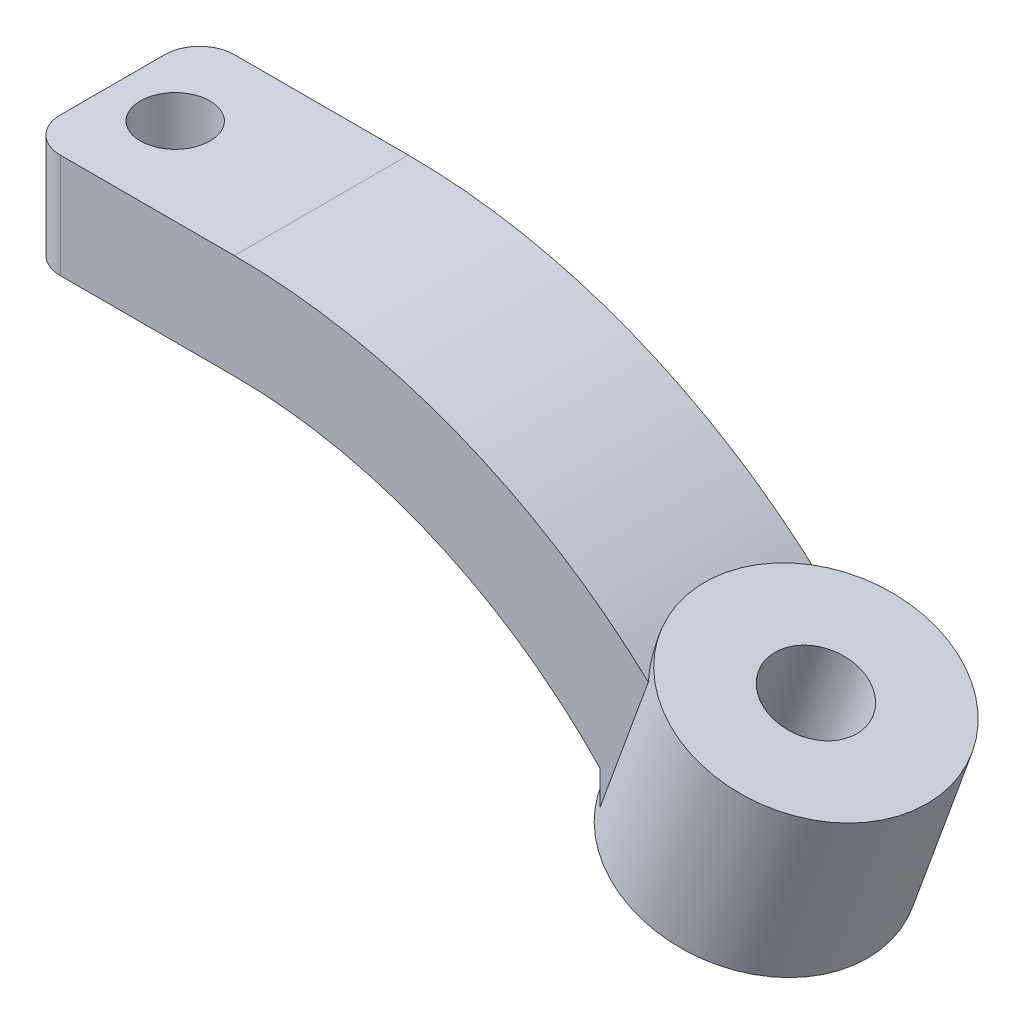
ISO-10303-21;
HEADER;
FILE_DESCRIPTION(('STEP AP214'),'2;1');
FILE_NAME('part.step','',(''),(''),'','','');
FILE_SCHEMA(('AUTOMOTIVE_DESIGN { 1 0 10303 214 1 1 1 1 }'));
ENDSEC;
DATA;
#1=APPLICATION_CONTEXT('core data for automotive mechanical design processes');
#2=APPLICATION_PROTOCOL_DEFINITION('international standard','automotive_design',2000,#1);
#3=PRODUCT_CONTEXT('',#1,'mechanical');
#4=PRODUCT('Part','Part','',(#3));
#5=PRODUCT_RELATED_PRODUCT_CATEGORY('part','',(#4));
#6=PRODUCT_DEFINITION_FORMATION('','',#4);
#7=PRODUCT_DEFINITION_CONTEXT('part definition',#1,'design');
#8=PRODUCT_DEFINITION('design','',#6,#7);
#9=PRODUCT_DEFINITION_SHAPE('','',#8);
#10=(LENGTH_UNIT() NAMED_UNIT(*) SI_UNIT(.MILLI.,.METRE.));
#11=(NAMED_UNIT(*) PLANE_ANGLE_UNIT() SI_UNIT($,.RADIAN.));
#12=(NAMED_UNIT(*) SI_UNIT($,.STERADIAN.) SOLID_ANGLE_UNIT());
#13=UNCERTAINTY_MEASURE_WITH_UNIT(LENGTH_MEASURE(1.E-05),#10,'distance_accuracy_value','');
#14=(GEOMETRIC_REPRESENTATION_CONTEXT(3) GLOBAL_UNCERTAINTY_ASSIGNED_CONTEXT((#13)) GLOBAL_UNIT_ASSIGNED_CONTEXT((#10,
#11,#12)) REPRESENTATION_CONTEXT('',''));
#15=CARTESIAN_POINT('',(0.,0.,0.));
#16=DIRECTION('',(0.,0.,1.));
#17=DIRECTION('',(1.,0.,0.));
#18=AXIS2_PLACEMENT_3D('',#15,#16,#17);
#19=CARTESIAN_POINT('',(13.5015966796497,-7.5,2.5));
#20=DIRECTION('',(1.,0.,0.));
#21=DIRECTION('',(0.,0.,-1.));
#22=AXIS2_PLACEMENT_3D('',#19,#20,#21);
#23=PLANE('',#22);
#24=DIRECTION('',(0.,-1.,0.));
#25=VECTOR('',#24,1.);
#26=CARTESIAN_POINT('',(13.5015966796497,-7.5,-2.5));
#27=LINE('',#26,#25);
#28=CARTESIAN_POINT('',(13.5015966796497,-6.,-2.5));
#29=VERTEX_POINT('',#28);
#30=CARTESIAN_POINT('',(13.5015966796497,-6.99133107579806,-2.5));
#31=VERTEX_POINT('',#30);
#32=EDGE_CURVE('E205',#29,#31,#27,.T.);
#33=ORIENTED_EDGE('',*,*,#32,.T.);
#34=CARTESIAN_POINT('',(13.5015966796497,-13.7160811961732,0.));
#35=DIRECTION('',(1.,0.,0.));
#36=DIRECTION('',(0.,-1.,0.));
#37=AXIS2_PLACEMENT_3D('',#34,#35,#36);
#38=ELLIPSE('',#37,9.93233181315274,3.39705755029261);
#39=CARTESIAN_POINT('',(13.5015966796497,-6.,-2.13901558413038));
#40=VERTEX_POINT('',#39);
#41=EDGE_CURVE('E129',#31,#40,#38,.T.);
#42=ORIENTED_EDGE('',*,*,#41,.T.);
#43=DIRECTION('',(0.,0.,-1.));
#44=VECTOR('',#43,1.);
#45=CARTESIAN_POINT('',(13.5015966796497,-6.,2.5));
#46=LINE('',#45,#44);
#47=EDGE_CURVE('E137',#40,#29,#46,.T.);
#48=ORIENTED_EDGE('',*,*,#47,.T.);
#49=EDGE_LOOP('',(#33,#42,#48));
#50=FACE_BOUND('',#49,.T.);
#51=ADVANCED_FACE('F36',(#50),#23,.F.);
#52=CARTESIAN_POINT('',(3.,-16.0037258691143,2.5));
#53=DIRECTION('',(0.,0.,-1.));
#54=DIRECTION('',(-1.,0.,0.));
#55=AXIS2_PLACEMENT_3D('',#52,#53,#54);
#56=CYLINDRICAL_SURFACE('',#55,17.5037258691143);
#57=CARTESIAN_POINT('',(14.8950510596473,-3.16284663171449,-2.5));
#58=CARTESIAN_POINT('',(14.8427995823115,-3.1144416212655,-2.43961248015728));
#59=CARTESIAN_POINT('',(14.7920429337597,-3.0680185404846,-2.37633457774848));
#60=CARTESIAN_POINT('',(14.6940296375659,-2.97934705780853,-2.24435312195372));
#61=CARTESIAN_POINT('',(14.6467736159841,-2.93709940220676,-2.17564860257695));
#62=CARTESIAN_POINT('',(14.5562743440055,-2.85699233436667,-2.03316471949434));
#63=CARTESIAN_POINT('',(14.5130325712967,-2.81913453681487,-1.9593835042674));
#64=CARTESIAN_POINT('',(14.4310790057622,-2.74801801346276,-1.80726996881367));
#65=CARTESIAN_POINT('',(14.392366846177,-2.71475891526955,-1.72893801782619));
#66=CARTESIAN_POINT('',(14.2835917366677,-2.6220179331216,-1.48758105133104));
#67=CARTESIAN_POINT('',(14.2209577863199,-2.56963150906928,-1.31830060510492));
#68=CARTESIAN_POINT('',(14.1187034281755,-2.48487578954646,-0.96838370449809));
#69=CARTESIAN_POINT('',(14.0790676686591,-2.45249314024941,-0.787754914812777));
#70=CARTESIAN_POINT('',(14.0252202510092,-2.40864884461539,-0.424715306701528));
#71=CARTESIAN_POINT('',(14.0104262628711,-2.39670787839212,-0.242449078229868));
#72=CARTESIAN_POINT('',(14.0051326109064,-2.39242567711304,0.122692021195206));
#73=CARTESIAN_POINT('',(14.0146362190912,-2.4000870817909,0.305566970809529));
#74=CARTESIAN_POINT('',(14.0572804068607,-2.43472816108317,0.664700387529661));
#75=CARTESIAN_POINT('',(14.0901729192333,-2.46150510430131,0.841008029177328));
#76=CARTESIAN_POINT('',(14.1778744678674,-2.53380597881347,1.18411641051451));
#77=CARTESIAN_POINT('',(14.2326891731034,-2.57933475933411,1.35091467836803));
#78=CARTESIAN_POINT('',(14.3622629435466,-2.68882349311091,1.67159302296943));
#79=CARTESIAN_POINT('',(14.4371648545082,-2.75291572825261,1.82536976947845));
#80=CARTESIAN_POINT('',(14.6034046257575,-2.89824955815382,2.11460688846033));
#81=CARTESIAN_POINT('',(14.6947149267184,-2.9794624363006,2.25009731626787));
#82=CARTESIAN_POINT('',(14.8089961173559,-3.08364263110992,2.39638608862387));
#83=CARTESIAN_POINT('',(14.8259730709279,-3.09917918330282,2.41756576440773));
#84=CARTESIAN_POINT('',(14.8602605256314,-3.13068509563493,2.45926781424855));
#85=CARTESIAN_POINT('',(14.8775706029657,-3.14665391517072,2.47979094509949));
#86=CARTESIAN_POINT('',(14.8950510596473,-3.16284663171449,2.5));
#87=B_SPLINE_CURVE_WITH_KNOTS('',3,(#57,#58,#59,#60,#61,#62,#63,#64,#65,#66,#67,#68,#69,#70,#71,
#72,#73,#74,#75,#76,#77,#78,#79,#80,#81,#82,#83,#84,#85,#86),.UNSPECIFIED.,.F.,.F.,(4,2,2,2,2,2,
2,2,2,2,2,2,2,2,4),(0.,0.280071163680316,0.560192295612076,0.840416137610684,1.12061727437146,
1.68143034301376,2.24186862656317,2.78897591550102,3.33615688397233,3.87761928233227,
4.41922179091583,4.96478289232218,5.50943609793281,5.60326050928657,5.6969725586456),.UNSPECIFIED.);
#88=CARTESIAN_POINT('',(14.8950510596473,-3.16284663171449,-2.5));
#89=VERTEX_POINT('',#88);
#90=CARTESIAN_POINT('',(14.8950510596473,-3.16284663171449,2.5));
#91=VERTEX_POINT('',#90);
#92=EDGE_CURVE('E138',#89,#91,#87,.T.);
#93=ORIENTED_EDGE('',*,*,#92,.F.);
#94=CARTESIAN_POINT('',(3.,-16.0037258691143,-2.5));
#95=DIRECTION('',(0.,0.,1.));
#96=DIRECTION('',(1.,0.,0.));
#97=AXIS2_PLACEMENT_3D('',#94,#95,#96);
#98=CIRCLE('',#97,17.5037258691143);
#99=CARTESIAN_POINT('',(3.,1.5,-2.5));
#100=VERTEX_POINT('',#99);
#101=EDGE_CURVE('E186',#100,#89,#98,.F.);
#102=ORIENTED_EDGE('',*,*,#101,.F.);
#103=DIRECTION('',(0.,0.,-1.));
#104=VECTOR('',#103,1.);
#105=CARTESIAN_POINT('',(3.,1.5,2.5));
#106=LINE('',#105,#104);
#107=CARTESIAN_POINT('',(3.,1.5,2.5));
#108=VERTEX_POINT('',#107);
#109=EDGE_CURVE('E156',#108,#100,#106,.T.);
#110=ORIENTED_EDGE('',*,*,#109,.F.);
#111=CARTESIAN_POINT('',(3.,-16.0037258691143,2.5));
#112=DIRECTION('',(0.,0.,1.));
#113=DIRECTION('',(1.,0.,0.));
#114=AXIS2_PLACEMENT_3D('',#111,#112,#113);
#115=CIRCLE('',#114,17.5037258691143);
#116=EDGE_CURVE('E185',#108,#91,#115,.F.);
#117=ORIENTED_EDGE('',*,*,#116,.T.);
#118=EDGE_LOOP('',(#93,#102,#110,#117));
#119=FACE_BOUND('',#118,.T.);
#120=ADVANCED_FACE('F224',(#119),#56,.T.);
#121=CARTESIAN_POINT('',(0.,1.5,2.5));
#122=DIRECTION('',(0.,-1.,0.));
#123=DIRECTION('',(1.,0.,0.));
#124=AXIS2_PLACEMENT_3D('',#121,#122,#123);
#125=PLANE('',#124);
#126=CARTESIAN_POINT('',(-1.2,1.5,0.));
#127=DIRECTION('',(0.,-1.,0.));
#128=DIRECTION('',(1.,0.,0.));
#129=AXIS2_PLACEMENT_3D('',#126,#127,#128);
#130=CIRCLE('',#129,1.);
#131=CARTESIAN_POINT('',(-0.2,1.5,0.));
#132=VERTEX_POINT('',#131);
#133=EDGE_CURVE('E191',#132,#132,#130,.T.);
#134=ORIENTED_EDGE('',*,*,#133,.T.);
#135=EDGE_LOOP('',(#134));
#136=FACE_BOUND('',#135,.T.);
#137=DIRECTION('',(-1.,0.,0.));
#138=VECTOR('',#137,1.);
#139=CARTESIAN_POINT('',(0.,1.5,-2.5));
#140=LINE('',#139,#138);
#141=CARTESIAN_POINT('',(-2.,1.5,-2.5));
#142=VERTEX_POINT('',#141);
#143=EDGE_CURVE('E170',#100,#142,#140,.T.);
#144=ORIENTED_EDGE('',*,*,#143,.T.);
#145=CARTESIAN_POINT('',(-2.,1.5,-1.5));
#146=DIRECTION('',(0.,-1.,0.));
#147=DIRECTION('',(1.,0.,0.));
#148=AXIS2_PLACEMENT_3D('',#145,#146,#147);
#149=CIRCLE('',#148,1.);
#150=CARTESIAN_POINT('',(-3.,1.5,-1.5));
#151=VERTEX_POINT('',#150);
#152=EDGE_CURVE('E44',#142,#151,#149,.F.);
#153=ORIENTED_EDGE('',*,*,#152,.T.);
#154=DIRECTION('',(0.,0.,-1.));
#155=VECTOR('',#154,1.);
#156=CARTESIAN_POINT('',(-3.,1.5,2.5));
#157=LINE('',#156,#155);
#158=CARTESIAN_POINT('',(-3.,1.5,1.5));
#159=VERTEX_POINT('',#158);
#160=EDGE_CURVE('E153',#159,#151,#157,.T.);
#161=ORIENTED_EDGE('',*,*,#160,.F.);
#162=CARTESIAN_POINT('',(-2.,1.5,1.5));
#163=DIRECTION('',(0.,-1.,0.));
#164=DIRECTION('',(1.,0.,0.));
#165=AXIS2_PLACEMENT_3D('',#162,#163,#164);
#166=CIRCLE('',#165,1.);
#167=CARTESIAN_POINT('',(-2.,1.5,2.5));
#168=VERTEX_POINT('',#167);
#169=EDGE_CURVE('E51',#159,#168,#166,.F.);
#170=ORIENTED_EDGE('',*,*,#169,.T.);
#171=DIRECTION('',(-1.,0.,0.));
#172=VECTOR('',#171,1.);
#173=CARTESIAN_POINT('',(0.,1.5,2.5));
#174=LINE('',#173,#172);
#175=EDGE_CURVE('E196',#108,#168,#174,.T.);
#176=ORIENTED_EDGE('',*,*,#175,.F.);
#177=ORIENTED_EDGE('',*,*,#109,.T.);
#178=EDGE_LOOP('',(#144,#153,#161,#170,#176,#177));
#179=FACE_BOUND('',#178,.T.);
#180=ADVANCED_FACE('F169',(#136,#179),#125,.F.);
#181=CARTESIAN_POINT('',(-3.,0.,2.5));
#182=DIRECTION('',(1.,0.,0.));
#183=DIRECTION('',(0.,0.,-1.));
#184=AXIS2_PLACEMENT_3D('',#181,#182,#183);
#185=PLANE('',#184);
#186=ORIENTED_EDGE('',*,*,#160,.T.);
#187=DIRECTION('',(0.,-1.,0.));
#188=VECTOR('',#187,1.);
#189=CARTESIAN_POINT('',(-3.,0.,-1.5));
#190=LINE('',#189,#188);
#191=CARTESIAN_POINT('',(-3.,-1.5,-1.5));
#192=VERTEX_POINT('',#191);
#193=EDGE_CURVE('E160',#151,#192,#190,.T.);
#194=ORIENTED_EDGE('',*,*,#193,.T.);
#195=DIRECTION('',(0.,0.,-1.));
#196=VECTOR('',#195,1.);
#197=CARTESIAN_POINT('',(-3.,-1.5,2.5));
#198=LINE('',#197,#196);
#199=CARTESIAN_POINT('',(-3.,-1.5,1.5));
#200=VERTEX_POINT('',#199);
#201=EDGE_CURVE('E144',#200,#192,#198,.T.);
#202=ORIENTED_EDGE('',*,*,#201,.F.);
#203=DIRECTION('',(0.,-1.,0.));
#204=VECTOR('',#203,1.);
#205=CARTESIAN_POINT('',(-3.,1.5,1.5));
#206=LINE('',#205,#204);
#207=EDGE_CURVE('E158',#200,#159,#206,.F.);
#208=ORIENTED_EDGE('',*,*,#207,.T.);
#209=EDGE_LOOP('',(#186,#194,#202,#208));
#210=FACE_BOUND('',#209,.T.);
#211=ADVANCED_FACE('F174',(#210),#185,.F.);
#212=CARTESIAN_POINT('',(0.,-1.5,2.5));
#213=DIRECTION('',(0.,-1.,0.));
#214=DIRECTION('',(1.,0.,0.));
#215=AXIS2_PLACEMENT_3D('',#212,#213,#214);
#216=PLANE('',#215);
#217=CARTESIAN_POINT('',(-1.2,-1.5,0.));
#218=DIRECTION('',(0.,-1.,0.));
#219=DIRECTION('',(1.,0.,0.));
#220=AXIS2_PLACEMENT_3D('',#217,#218,#219);
#221=CIRCLE('',#220,1.);
#222=CARTESIAN_POINT('',(-0.2,-1.5,0.));
#223=VERTEX_POINT('',#222);
#224=EDGE_CURVE('E202',#223,#223,#221,.T.);
#225=ORIENTED_EDGE('',*,*,#224,.F.);
#226=EDGE_LOOP('',(#225));
#227=FACE_BOUND('',#226,.T.);
#228=ORIENTED_EDGE('',*,*,#201,.T.);
#229=CARTESIAN_POINT('',(-2.,-1.5,-1.5));
#230=DIRECTION('',(0.,-1.,0.));
#231=DIRECTION('',(1.,0.,0.));
#232=AXIS2_PLACEMENT_3D('',#229,#230,#231);
#233=CIRCLE('',#232,1.);
#234=CARTESIAN_POINT('',(-2.,-1.5,-2.5));
#235=VERTEX_POINT('',#234);
#236=EDGE_CURVE('E165',#192,#235,#233,.T.);
#237=ORIENTED_EDGE('',*,*,#236,.T.);
#238=DIRECTION('',(-1.,0.,0.));
#239=VECTOR('',#238,1.);
#240=CARTESIAN_POINT('',(0.,-1.5,-2.5));
#241=LINE('',#240,#239);
#242=CARTESIAN_POINT('',(3.,-1.5,-2.5));
#243=VERTEX_POINT('',#242);
#244=EDGE_CURVE('E181',#243,#235,#241,.T.);
#245=ORIENTED_EDGE('',*,*,#244,.F.);
#246=DIRECTION('',(0.,0.,-1.));
#247=VECTOR('',#246,1.);
#248=CARTESIAN_POINT('',(3.,-1.5,2.5));
#249=LINE('',#248,#247);
#250=CARTESIAN_POINT('',(3.,-1.5,2.5));
#251=VERTEX_POINT('',#250);
#252=EDGE_CURVE('E142',#251,#243,#249,.T.);
#253=ORIENTED_EDGE('',*,*,#252,.F.);
#254=DIRECTION('',(-1.,0.,0.));
#255=VECTOR('',#254,1.);
#256=CARTESIAN_POINT('',(0.,-1.5,2.5));
#257=LINE('',#256,#255);
#258=CARTESIAN_POINT('',(-2.,-1.5,2.5));
#259=VERTEX_POINT('',#258);
#260=EDGE_CURVE('E193',#251,#259,#257,.T.);
#261=ORIENTED_EDGE('',*,*,#260,.T.);
#262=CARTESIAN_POINT('',(-2.,-1.5,1.5));
#263=DIRECTION('',(0.,-1.,0.));
#264=DIRECTION('',(1.,0.,0.));
#265=AXIS2_PLACEMENT_3D('',#262,#263,#264);
#266=CIRCLE('',#265,1.);
#267=EDGE_CURVE('E163',#259,#200,#266,.T.);
#268=ORIENTED_EDGE('',*,*,#267,.T.);
#269=EDGE_LOOP('',(#228,#237,#245,#253,#261,#268));
#270=FACE_BOUND('',#269,.T.);
#271=ADVANCED_FACE('F180',(#227,#270),#216,.T.);
#272=CARTESIAN_POINT('',(3.,-16.0037258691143,2.5));
#273=DIRECTION('',(0.,0.,-1.));
#274=DIRECTION('',(-1.,0.,0.));
#275=AXIS2_PLACEMENT_3D('',#272,#273,#274);
#276=CYLINDRICAL_SURFACE('',#275,14.5037258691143);
#277=ORIENTED_EDGE('',*,*,#47,.F.);
#278=CARTESIAN_POINT('',(13.5015966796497,-6.,-2.13901558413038));
#279=CARTESIAN_POINT('',(13.4598044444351,-5.95612777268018,-2.07206961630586));
#280=CARTESIAN_POINT('',(13.419606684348,-5.91448013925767,-2.00266301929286));
#281=CARTESIAN_POINT('',(13.3428607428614,-5.83581970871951,-1.85933338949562));
#282=CARTESIAN_POINT('',(13.306313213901,-5.7988077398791,-1.78540955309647));
#283=CARTESIAN_POINT('',(13.2373344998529,-5.72961094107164,-1.63345438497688));
#284=CARTESIAN_POINT('',(13.2049044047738,-5.69742738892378,-1.55542197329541));
#285=CARTESIAN_POINT('',(13.1445956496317,-5.63806014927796,-1.39581305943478));
#286=CARTESIAN_POINT('',(13.1167166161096,-5.61087605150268,-1.31423684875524));
#287=CARTESIAN_POINT('',(13.0403947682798,-5.5369389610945,-1.06470348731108));
#288=CARTESIAN_POINT('',(12.9993204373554,-5.4978538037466,-0.892057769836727));
#289=CARTESIAN_POINT('',(12.9391996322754,-5.44095598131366,-0.53977771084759));
#290=CARTESIAN_POINT('',(12.9201383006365,-5.42312896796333,-0.360148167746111));
#291=CARTESIAN_POINT('',(12.9051348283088,-5.40908246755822,-0.00306751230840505));
#292=CARTESIAN_POINT('',(12.9086903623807,-5.41239350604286,0.174343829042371));
#293=CARTESIAN_POINT('',(12.9375818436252,-5.4394978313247,0.525861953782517));
#294=CARTESIAN_POINT('',(12.9629257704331,-5.4632986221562,0.699967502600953));
#295=CARTESIAN_POINT('',(13.0339153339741,-5.53085726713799,1.03903226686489));
#296=CARTESIAN_POINT('',(13.079464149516,-5.57451996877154,1.20403093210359));
#297=CARTESIAN_POINT('',(13.1885449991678,-5.68106289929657,1.52126921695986));
#298=CARTESIAN_POINT('',(13.2520585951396,-5.74392342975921,1.67352171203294));
#299=CARTESIAN_POINT('',(13.3506091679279,-5.84377982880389,1.87371911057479));
#300=CARTESIAN_POINT('',(13.3794291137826,-5.87321007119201,1.92871429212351));
#301=CARTESIAN_POINT('',(13.4390594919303,-5.9346676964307,2.0359363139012));
#302=CARTESIAN_POINT('',(13.4698658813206,-5.96668983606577,2.08816840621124));
#303=CARTESIAN_POINT('',(13.5015966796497,-6.,2.13901558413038));
#304=B_SPLINE_CURVE_WITH_KNOTS('',3,(#278,#279,#280,#281,#282,#283,#284,#285,#286,#287,#288,
#289,#290,#291,#292,#293,#294,#295,#296,#297,#298,#299,#300,#301,#302,#303),.UNSPECIFIED.,.F.,
.F.,(4,2,2,2,2,2,2,2,2,2,2,2,4),(0.,0.270816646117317,0.541681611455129,0.812618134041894,
1.08353241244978,1.62577023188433,2.16764185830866,2.69752107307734,3.22759442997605,
3.75515468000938,4.28217542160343,4.48820489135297,4.69382752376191),.UNSPECIFIED.);
#305=CARTESIAN_POINT('',(13.5015966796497,-6.,2.13901558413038));
#306=VERTEX_POINT('',#305);
#307=EDGE_CURVE('E119',#40,#306,#304,.T.);
#308=ORIENTED_EDGE('',*,*,#307,.T.);
#309=CARTESIAN_POINT('',(13.5015966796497,-6.,2.5));
#310=VERTEX_POINT('',#309);
#311=EDGE_CURVE('E135',#310,#306,#46,.T.);
#312=ORIENTED_EDGE('',*,*,#311,.F.);
#313=CARTESIAN_POINT('',(3.,-16.0037258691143,2.5));
#314=DIRECTION('',(0.,0.,1.));
#315=DIRECTION('',(1.,0.,0.));
#316=AXIS2_PLACEMENT_3D('',#313,#314,#315);
#317=CIRCLE('',#316,14.5037258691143);
#318=EDGE_CURVE('E146',#251,#310,#317,.F.);
#319=ORIENTED_EDGE('',*,*,#318,.F.);
#320=ORIENTED_EDGE('',*,*,#252,.T.);
#321=CARTESIAN_POINT('',(3.,-16.0037258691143,-2.5));
#322=DIRECTION('',(0.,0.,1.));
#323=DIRECTION('',(1.,0.,0.));
#324=AXIS2_PLACEMENT_3D('',#321,#322,#323);
#325=CIRCLE('',#324,14.5037258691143);
#326=EDGE_CURVE('E148',#243,#29,#325,.F.);
#327=ORIENTED_EDGE('',*,*,#326,.T.);
#328=EDGE_LOOP('',(#277,#308,#312,#319,#320,#327));
#329=FACE_BOUND('',#328,.T.);
#330=ADVANCED_FACE('F133',(#329),#276,.F.);
#331=CARTESIAN_POINT('',(0.,0.,2.5));
#332=DIRECTION('',(0.,0.,1.));
#333=DIRECTION('',(1.,0.,0.));
#334=AXIS2_PLACEMENT_3D('',#331,#332,#333);
#335=PLANE('',#334);
#336=ORIENTED_EDGE('',*,*,#175,.T.);
#337=DIRECTION('',(0.,-1.,0.));
#338=VECTOR('',#337,1.);
#339=CARTESIAN_POINT('',(-2.,-1.5,2.5));
#340=LINE('',#339,#338);
#341=EDGE_CURVE('E11',#168,#259,#340,.T.);
#342=ORIENTED_EDGE('',*,*,#341,.T.);
#343=ORIENTED_EDGE('',*,*,#260,.F.);
#344=ORIENTED_EDGE('',*,*,#318,.T.);
#345=DIRECTION('',(0.,-1.,0.));
#346=VECTOR('',#345,1.);
#347=CARTESIAN_POINT('',(13.5015966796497,-7.5,2.5));
#348=LINE('',#347,#346);
#349=CARTESIAN_POINT('',(13.5015966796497,-6.99133107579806,2.5));
#350=VERTEX_POINT('',#349);
#351=EDGE_CURVE('E141',#310,#350,#348,.T.);
#352=ORIENTED_EDGE('',*,*,#351,.T.);
#353=DIRECTION('',(-0.34202014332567,-0.939692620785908,0.));
#354=VECTOR('',#353,1.);
#355=CARTESIAN_POINT('',(15.0482143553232,-2.74203393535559,2.5));
#356=LINE('',#355,#354);
#357=EDGE_CURVE('E122',#91,#350,#356,.T.);
#358=ORIENTED_EDGE('',*,*,#357,.F.);
#359=ORIENTED_EDGE('',*,*,#116,.F.);
#360=EDGE_LOOP('',(#336,#342,#343,#344,#352,#358,#359));
#361=FACE_BOUND('',#360,.T.);
#362=ADVANCED_FACE('F246',(#361),#335,.T.);
#363=CARTESIAN_POINT('',(0.,0.,-2.5));
#364=DIRECTION('',(0.,0.,1.));
#365=DIRECTION('',(1.,0.,0.));
#366=AXIS2_PLACEMENT_3D('',#363,#364,#365);
#367=PLANE('',#366);
#368=ORIENTED_EDGE('',*,*,#244,.T.);
#369=DIRECTION('',(0.,-1.,0.));
#370=VECTOR('',#369,1.);
#371=CARTESIAN_POINT('',(-2.,0.,-2.5));
#372=LINE('',#371,#370);
#373=EDGE_CURVE('E59',#235,#142,#372,.F.);
#374=ORIENTED_EDGE('',*,*,#373,.T.);
#375=ORIENTED_EDGE('',*,*,#143,.F.);
#376=ORIENTED_EDGE('',*,*,#101,.T.);
#377=DIRECTION('',(-0.34202014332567,-0.939692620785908,0.));
#378=VECTOR('',#377,1.);
#379=CARTESIAN_POINT('',(15.0482143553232,-2.74203393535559,-2.5));
#380=LINE('',#379,#378);
#381=EDGE_CURVE('E208',#89,#31,#380,.T.);
#382=ORIENTED_EDGE('',*,*,#381,.T.);
#383=ORIENTED_EDGE('',*,*,#32,.F.);
#384=ORIENTED_EDGE('',*,*,#326,.F.);
#385=EDGE_LOOP('',(#368,#374,#375,#376,#382,#383,#384));
#386=FACE_BOUND('',#385,.T.);
#387=ADVANCED_FACE('F183',(#386),#367,.F.);
#388=CARTESIAN_POINT('',(-1.2,3.5,0.));
#389=DIRECTION('',(0.,-1.,0.));
#390=DIRECTION('',(1.,0.,0.));
#391=AXIS2_PLACEMENT_3D('',#388,#389,#390);
#392=CYLINDRICAL_SURFACE('',#391,1.);
#393=ORIENTED_EDGE('',*,*,#224,.T.);
#394=EDGE_LOOP('',(#393));
#395=FACE_BOUND('',#394,.T.);
#396=ORIENTED_EDGE('',*,*,#133,.F.);
#397=EDGE_LOOP('',(#396));
#398=FACE_BOUND('',#397,.T.);
#399=ADVANCED_FACE('F242',(#395,#398),#392,.F.);
#400=ORIENTED_EDGE('',*,*,#311,.T.);
#401=EDGE_CURVE('E116',#306,#350,#38,.T.);
#402=ORIENTED_EDGE('',*,*,#401,.T.);
#403=ORIENTED_EDGE('',*,*,#351,.F.);
#404=EDGE_LOOP('',(#400,#402,#403));
#405=FACE_BOUND('',#404,.T.);
#406=ADVANCED_FACE('F140',(#405),#23,.F.);
#407=CARTESIAN_POINT('',(17.2095073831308,-3.52868026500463,0.));
#408=DIRECTION('',(-0.34202014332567,-0.939692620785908,0.));
#409=DIRECTION('',(0.939692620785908,-0.34202014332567,0.));
#410=AXIS2_PLACEMENT_3D('',#407,#408,#409);
#411=CYLINDRICAL_SURFACE('',#410,3.39705755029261);
#412=CARTESIAN_POINT('',(15.4994066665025,-8.22714336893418,0.));
#413=DIRECTION('',(-0.34202014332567,-0.939692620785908,0.));
#414=DIRECTION('',(0.939692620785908,-0.34202014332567,0.));
#415=AXIS2_PLACEMENT_3D('',#412,#413,#414);
#416=CIRCLE('',#415,3.39705755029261);
#417=CARTESIAN_POINT('',(18.6915965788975,-9.3890054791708,0.));
#418=VERTEX_POINT('',#417);
#419=EDGE_CURVE('E273',#418,#418,#416,.T.);
#420=ORIENTED_EDGE('',*,*,#419,.F.);
#421=EDGE_LOOP('',(#420));
#422=FACE_BOUND('',#421,.T.);
#423=CARTESIAN_POINT('',(17.2095073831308,-3.52868026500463,0.));
#424=DIRECTION('',(-0.34202014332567,-0.939692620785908,0.));
#425=DIRECTION('',(0.939692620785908,-0.34202014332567,0.));
#426=AXIS2_PLACEMENT_3D('',#423,#424,#425);
#427=CIRCLE('',#426,3.39705755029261);
#428=CARTESIAN_POINT('',(20.4016972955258,-4.69054237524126,0.));
#429=VERTEX_POINT('',#428);
#430=EDGE_CURVE('E127',#429,#429,#427,.T.);
#431=ORIENTED_EDGE('',*,*,#430,.T.);
#432=EDGE_LOOP('',(#431));
#433=FACE_BOUND('',#432,.T.);
#434=ORIENTED_EDGE('',*,*,#381,.F.);
#435=ORIENTED_EDGE('',*,*,#92,.T.);
#436=ORIENTED_EDGE('',*,*,#357,.T.);
#437=ORIENTED_EDGE('',*,*,#401,.F.);
#438=ORIENTED_EDGE('',*,*,#307,.F.);
#439=ORIENTED_EDGE('',*,*,#41,.F.);
#440=EDGE_LOOP('',(#434,#435,#436,#437,#438,#439));
#441=FACE_BOUND('',#440,.T.);
#442=ADVANCED_FACE('F118',(#422,#433,#441),#411,.T.);
#443=CARTESIAN_POINT('',(17.2095073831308,-3.52868026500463,0.));
#444=DIRECTION('',(-0.34202014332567,-0.939692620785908,0.));
#445=DIRECTION('',(0.939692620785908,-0.34202014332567,0.));
#446=AXIS2_PLACEMENT_3D('',#443,#444,#445);
#447=PLANE('',#446);
#448=CARTESIAN_POINT('',(17.2095073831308,-3.52868026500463,0.));
#449=DIRECTION('',(-0.34202014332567,-0.939692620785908,0.));
#450=DIRECTION('',(0.939692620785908,-0.34202014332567,0.));
#451=AXIS2_PLACEMENT_3D('',#448,#449,#450);
#452=CIRCLE('',#451,1.25);
#453=CARTESIAN_POINT('',(18.3841231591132,-3.95620544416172,0.));
#454=VERTEX_POINT('',#453);
#455=EDGE_CURVE('E276',#454,#454,#452,.T.);
#456=ORIENTED_EDGE('',*,*,#455,.T.);
#457=EDGE_LOOP('',(#456));
#458=FACE_BOUND('',#457,.T.);
#459=ORIENTED_EDGE('',*,*,#430,.F.);
#460=EDGE_LOOP('',(#459));
#461=FACE_BOUND('',#460,.T.);
#462=ADVANCED_FACE('F231',(#458,#461),#447,.F.);
#463=CARTESIAN_POINT('',(17.6606996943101,-9.01378969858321,2.5));
#464=DIRECTION('',(0.34202014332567,0.939692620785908,0.));
#465=DIRECTION('',(-0.939692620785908,0.34202014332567,0.));
#466=AXIS2_PLACEMENT_3D('',#463,#464,#465);
#467=PLANE('',#466);
#468=CARTESIAN_POINT('',(15.4994066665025,-8.22714336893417,0.));
#469=DIRECTION('',(-0.34202014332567,-0.939692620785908,0.));
#470=DIRECTION('',(0.939692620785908,-0.34202014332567,0.));
#471=AXIS2_PLACEMENT_3D('',#468,#469,#470);
#472=CIRCLE('',#471,1.25);
#473=CARTESIAN_POINT('',(16.6740224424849,-8.65466854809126,0.));
#474=VERTEX_POINT('',#473);
#475=EDGE_CURVE('E279',#474,#474,#472,.T.);
#476=ORIENTED_EDGE('',*,*,#475,.F.);
#477=EDGE_LOOP('',(#476));
#478=FACE_BOUND('',#477,.T.);
#479=ORIENTED_EDGE('',*,*,#419,.T.);
#480=EDGE_LOOP('',(#479));
#481=FACE_BOUND('',#480,.T.);
#482=ADVANCED_FACE('F234',(#478,#481),#467,.F.);
#483=CARTESIAN_POINT('',(17.2095073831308,-3.52868026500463,0.));
#484=DIRECTION('',(-0.34202014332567,-0.939692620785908,0.));
#485=DIRECTION('',(0.939692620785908,-0.34202014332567,0.));
#486=AXIS2_PLACEMENT_3D('',#483,#484,#485);
#487=CYLINDRICAL_SURFACE('',#486,1.25);
#488=ORIENTED_EDGE('',*,*,#455,.F.);
#489=EDGE_LOOP('',(#488));
#490=FACE_BOUND('',#489,.T.);
#491=ORIENTED_EDGE('',*,*,#475,.T.);
#492=EDGE_LOOP('',(#491));
#493=FACE_BOUND('',#492,.T.);
#494=ADVANCED_FACE('F238',(#490,#493),#487,.F.);
#495=CARTESIAN_POINT('',(-2.,0.,-1.5));
#496=DIRECTION('',(0.,-1.,0.));
#497=DIRECTION('',(0.,0.,-1.));
#498=AXIS2_PLACEMENT_3D('',#495,#496,#497);
#499=CYLINDRICAL_SURFACE('',#498,1.);
#500=ORIENTED_EDGE('',*,*,#152,.F.);
#501=ORIENTED_EDGE('',*,*,#373,.F.);
#502=ORIENTED_EDGE('',*,*,#236,.F.);
#503=ORIENTED_EDGE('',*,*,#193,.F.);
#504=EDGE_LOOP('',(#500,#501,#502,#503));
#505=FACE_BOUND('',#504,.T.);
#506=ADVANCED_FACE('F177',(#505),#499,.T.);
#507=CARTESIAN_POINT('',(-2.,0.,1.5));
#508=DIRECTION('',(0.,1.,0.));
#509=DIRECTION('',(0.,0.,1.));
#510=AXIS2_PLACEMENT_3D('',#507,#508,#509);
#511=CYLINDRICAL_SURFACE('',#510,1.);
#512=ORIENTED_EDGE('',*,*,#169,.F.);
#513=ORIENTED_EDGE('',*,*,#207,.F.);
#514=ORIENTED_EDGE('',*,*,#267,.F.);
#515=ORIENTED_EDGE('',*,*,#341,.F.);
#516=EDGE_LOOP('',(#512,#513,#514,#515));
#517=FACE_BOUND('',#516,.T.);
#518=ADVANCED_FACE('F38',(#517),#511,.T.);
#519=CLOSED_SHELL('',(#51,#120,#180,#211,#271,#330,#362,#387,#399,#406,#442,#462,#482,#494,#506,#518));
#520=MANIFOLD_SOLID_BREP('B2',#519);
#521=ADVANCED_BREP_SHAPE_REPRESENTATION('',(#18,#520),#14);
#522=SHAPE_DEFINITION_REPRESENTATION(#9,#521);
ENDSEC;
END-ISO-10303-21;
